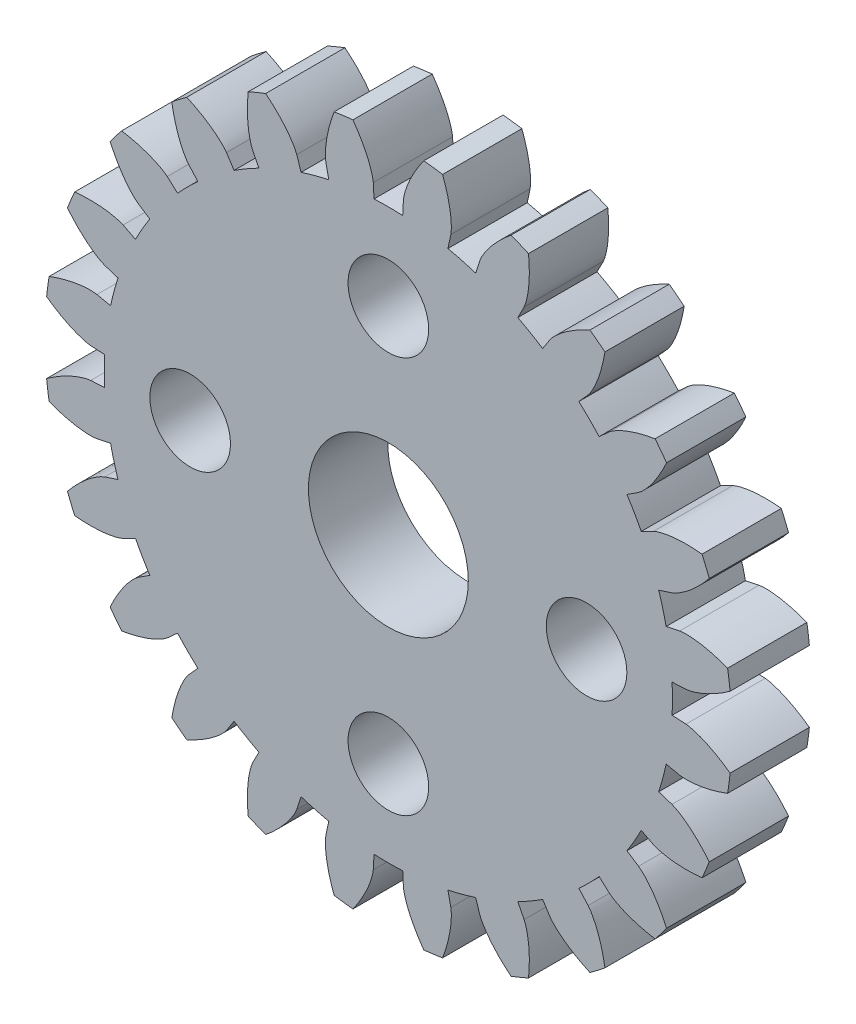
from build123d import *

# Parameters (mm, degrees)
EXTRUDE_1200_DEPTH          = 3
SKETCH_1285_R               = 37.176964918
SKETCH_1285_R_2             = 13
CUT_EXTRUDE_1626_DEPTH      = 39.958796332
CUT_EXTRUDE_2146_DEPTH      = 19.579565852
PATTERN_CIRCULAR_2249_COUNT = 24
SKETCH_2309_R               = 10.75
EXTRUDE_2632_DEPTH          = 3
SKETCH_3196_R               = 3.025
CUT_EXTRUDE_3847_DEPTH      = 19.53106928
SKETCH_1_R                  = 1.525
CUT_EXTRUDE_1_DEPTH         = 19.53106928


with BuildPart() as part:
    # Sketch 1018 → Extrude 1200 (new body)
    with BuildSketch(Plane.XY):
        with BuildLine():
            Line((-34.810597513, -13.051782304), (0.569734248, -11.261909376))
            Line((0.569734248, -11.261909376), (0, 0))
            Line((0, 0), (0, 10.73627013))
            Line((0, 10.73627013), (-0.543142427, 10.73627013))
            Line((-0.543142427, 10.73627013), (-0.569734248, 11.261909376))
            add(Edge.make_bspline(
                [(-0.569734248, 11.261909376), (-0.574039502, 11.304625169), (-0.58662303, 11.389421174), (-0.624880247, 11.548358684), (-0.699627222, 11.777149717), (-0.859532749, 12.161314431), (-1.181341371, 12.739542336), (-1.715210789, 13.454141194), (-2.596612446, 14.335278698), (-3.772336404, 15.202010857), (-5.187237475, 15.95872787), (-6.809569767, 16.555777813), (-8.492340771, 16.947544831), (-10.208004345, 17.146764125), (-12.020014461, 17.16644959), (-14.254309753, 16.95681711), (-16.868761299, 16.366827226), (-19.775097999, 15.244890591), (-22.771942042, 13.514750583), (-25.487635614, 11.372766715), (-27.888534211, 8.884747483), (-29.693862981, 6.45824407), (-31.021257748, 4.235120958), (-31.978360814, 2.303342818), (-32.653986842, 0.71630306), (-33.239321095, -0.905719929), (-33.734316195, -2.558294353), (-34.240622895, -4.652865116), (-34.597645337, -6.781899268), (-34.786628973, -8.711035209), (-34.848980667, -10.330102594), (-34.857641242, -11.185847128), (-34.853055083, -11.769522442), (-34.844894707, -12.225859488), (-34.828408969, -12.671101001), (-34.816961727, -12.925981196), (-34.810597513, -13.051782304)],
                knots=[0, 0, 0, 0, 0, 0.002802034, 0.005604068, 0.010661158, 0.015718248, 0.029959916, 0.048733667, 0.068727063, 0.096888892, 0.125050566, 0.153212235, 0.18137365, 0.209534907, 0.23769631, 0.271429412, 0.327752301, 0.384075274, 0.440398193, 0.496721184, 0.553044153, 0.609367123, 0.637528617, 0.665690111, 0.693851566, 0.72201302, 0.750174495, 0.77833597, 0.834658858, 0.862820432, 0.876901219, 0.883941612, 0.890982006, 0.90003647, 0.909090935, 0.909090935, 0.909090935, 0.909090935, 0.909090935], degree=4))
        make_face()
    extrude(amount=EXTRUDE_1200_DEPTH)

    # Mirror 1246: part across plane


with BuildPart() as part_1:
    add(part.part)
    add(part.part.mirror(Plane(origin=(0, 0, 3), x_dir=(0, 0, 1), z_dir=(1, 0, 0))))

    # Sketch 1285 → Cut-Extrude 1626 (cut, through all)
    with BuildSketch(Plane.XY.offset(3)):
        Circle(SKETCH_1285_R)
        Circle(SKETCH_1285_R_2, mode=Mode.SUBTRACT)
    extrude(amount=-CUT_EXTRUDE_1626_DEPTH, mode=Mode.SUBTRACT)

    # Sketch 1786 → Cut-Extrude 2146 (cut, through all)
    with BuildSketch(Plane.XY.offset(3)):
        with BuildLine():
            Line((-1.696840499, 12.888783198), (0, 0))
            Line((0, 0), (1.696840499, 12.888783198))
            ThreePointArc((1.696840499, 12.888783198), (0, -13), (-1.696840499, 12.888783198))
        make_face()
    extrude(amount=-CUT_EXTRUDE_2146_DEPTH, mode=Mode.SUBTRACT)


with BuildPart() as pattern_circular_2249_1:
    # Pattern Circular 2249: pattern copy
    add(part_1.part.rotate(Axis((0, 0, 0), (0, 0, 1)), 1 * 360 / PATTERN_CIRCULAR_2249_COUNT))


with BuildPart() as pattern_circular_2249_2:
    # Pattern Circular 2249: pattern copy
    add(part_1.part.rotate(Axis((0, 0, 0), (0, 0, 1)), 2 * 360 / PATTERN_CIRCULAR_2249_COUNT))


with BuildPart() as pattern_circular_2249_3:
    # Pattern Circular 2249: pattern copy
    add(part_1.part.rotate(Axis((0, 0, 0), (0, 0, 1)), 3 * 360 / PATTERN_CIRCULAR_2249_COUNT))


with BuildPart() as pattern_circular_2249_4:
    # Pattern Circular 2249: pattern copy
    add(part_1.part.rotate(Axis((0, 0, 0), (0, 0, 1)), 4 * 360 / PATTERN_CIRCULAR_2249_COUNT))


with BuildPart() as pattern_circular_2249_5:
    # Pattern Circular 2249: pattern copy
    add(part_1.part.rotate(Axis((0, 0, 0), (0, 0, 1)), 5 * 360 / PATTERN_CIRCULAR_2249_COUNT))


with BuildPart() as pattern_circular_2249_6:
    # Pattern Circular 2249: pattern copy
    add(part_1.part.rotate(Axis((0, 0, 0), (0, 0, 1)), 6 * 360 / PATTERN_CIRCULAR_2249_COUNT))


with BuildPart() as pattern_circular_2249_7:
    # Pattern Circular 2249: pattern copy
    add(part_1.part.rotate(Axis((0, 0, 0), (0, 0, 1)), 7 * 360 / PATTERN_CIRCULAR_2249_COUNT))


with BuildPart() as pattern_circular_2249_8:
    # Pattern Circular 2249: pattern copy
    add(part_1.part.rotate(Axis((0, 0, 0), (0, 0, 1)), 8 * 360 / PATTERN_CIRCULAR_2249_COUNT))


with BuildPart() as pattern_circular_2249_9:
    # Pattern Circular 2249: pattern copy
    add(part_1.part.rotate(Axis((0, 0, 0), (0, 0, 1)), 9 * 360 / PATTERN_CIRCULAR_2249_COUNT))


with BuildPart() as pattern_circular_2249_10:
    # Pattern Circular 2249: pattern copy
    add(part_1.part.rotate(Axis((0, 0, 0), (0, 0, 1)), 10 * 360 / PATTERN_CIRCULAR_2249_COUNT))


with BuildPart() as pattern_circular_2249_11:
    # Pattern Circular 2249: pattern copy
    add(part_1.part.rotate(Axis((0, 0, 0), (0, 0, 1)), 11 * 360 / PATTERN_CIRCULAR_2249_COUNT))


with BuildPart() as pattern_circular_2249_12:
    # Pattern Circular 2249: pattern copy
    add(part_1.part.rotate(Axis((0, 0, 0), (0, 0, 1)), 12 * 360 / PATTERN_CIRCULAR_2249_COUNT))


with BuildPart() as pattern_circular_2249_13:
    # Pattern Circular 2249: pattern copy
    add(part_1.part.rotate(Axis((0, 0, 0), (0, 0, 1)), 13 * 360 / PATTERN_CIRCULAR_2249_COUNT))


with BuildPart() as pattern_circular_2249_14:
    # Pattern Circular 2249: pattern copy
    add(part_1.part.rotate(Axis((0, 0, 0), (0, 0, 1)), 14 * 360 / PATTERN_CIRCULAR_2249_COUNT))


with BuildPart() as pattern_circular_2249_15:
    # Pattern Circular 2249: pattern copy
    add(part_1.part.rotate(Axis((0, 0, 0), (0, 0, 1)), 15 * 360 / PATTERN_CIRCULAR_2249_COUNT))


with BuildPart() as pattern_circular_2249_16:
    # Pattern Circular 2249: pattern copy
    add(part_1.part.rotate(Axis((0, 0, 0), (0, 0, 1)), 16 * 360 / PATTERN_CIRCULAR_2249_COUNT))


with BuildPart() as pattern_circular_2249_17:
    # Pattern Circular 2249: pattern copy
    add(part_1.part.rotate(Axis((0, 0, 0), (0, 0, 1)), 17 * 360 / PATTERN_CIRCULAR_2249_COUNT))


with BuildPart() as pattern_circular_2249_18:
    # Pattern Circular 2249: pattern copy
    add(part_1.part.rotate(Axis((0, 0, 0), (0, 0, 1)), 18 * 360 / PATTERN_CIRCULAR_2249_COUNT))


with BuildPart() as pattern_circular_2249_19:
    # Pattern Circular 2249: pattern copy
    add(part_1.part.rotate(Axis((0, 0, 0), (0, 0, 1)), 19 * 360 / PATTERN_CIRCULAR_2249_COUNT))


with BuildPart() as pattern_circular_2249_20:
    # Pattern Circular 2249: pattern copy
    add(part_1.part.rotate(Axis((0, 0, 0), (0, 0, 1)), 20 * 360 / PATTERN_CIRCULAR_2249_COUNT))


with BuildPart() as pattern_circular_2249_21:
    # Pattern Circular 2249: pattern copy
    add(part_1.part.rotate(Axis((0, 0, 0), (0, 0, 1)), 21 * 360 / PATTERN_CIRCULAR_2249_COUNT))


with BuildPart() as pattern_circular_2249_22:
    # Pattern Circular 2249: pattern copy
    add(part_1.part.rotate(Axis((0, 0, 0), (0, 0, 1)), 22 * 360 / PATTERN_CIRCULAR_2249_COUNT))


with BuildPart() as pattern_circular_2249_23:
    # Pattern Circular 2249: pattern copy
    add(part_1.part.rotate(Axis((0, 0, 0), (0, 0, 1)), 23 * 360 / PATTERN_CIRCULAR_2249_COUNT))


with BuildPart() as part_2:
    add(part_1.part)

    add(pattern_circular_2249_1.part)  # Extrude 2632 merges Pattern Circular 2249_1

    add(pattern_circular_2249_2.part)  # Extrude 2632 merges Pattern Circular 2249_2

    add(pattern_circular_2249_3.part)  # Extrude 2632 merges Pattern Circular 2249_3

    add(pattern_circular_2249_4.part)  # Extrude 2632 merges Pattern Circular 2249_4

    add(pattern_circular_2249_5.part)  # Extrude 2632 merges Pattern Circular 2249_5

    add(pattern_circular_2249_6.part)  # Extrude 2632 merges Pattern Circular 2249_6

    add(pattern_circular_2249_7.part)  # Extrude 2632 merges Pattern Circular 2249_7

    add(pattern_circular_2249_8.part)  # Extrude 2632 merges Pattern Circular 2249_8

    add(pattern_circular_2249_9.part)  # Extrude 2632 merges Pattern Circular 2249_9

    add(pattern_circular_2249_10.part)  # Extrude 2632 merges Pattern Circular 2249_10

    add(pattern_circular_2249_11.part)  # Extrude 2632 merges Pattern Circular 2249_11

    add(pattern_circular_2249_12.part)  # Extrude 2632 merges Pattern Circular 2249_12

    add(pattern_circular_2249_13.part)  # Extrude 2632 merges Pattern Circular 2249_13

    add(pattern_circular_2249_14.part)  # Extrude 2632 merges Pattern Circular 2249_14

    add(pattern_circular_2249_15.part)  # Extrude 2632 merges Pattern Circular 2249_15

    add(pattern_circular_2249_16.part)  # Extrude 2632 merges Pattern Circular 2249_16

    add(pattern_circular_2249_17.part)  # Extrude 2632 merges Pattern Circular 2249_17

    add(pattern_circular_2249_18.part)  # Extrude 2632 merges Pattern Circular 2249_18

    add(pattern_circular_2249_19.part)  # Extrude 2632 merges Pattern Circular 2249_19

    add(pattern_circular_2249_20.part)  # Extrude 2632 merges Pattern Circular 2249_20

    add(pattern_circular_2249_21.part)  # Extrude 2632 merges Pattern Circular 2249_21

    add(pattern_circular_2249_22.part)  # Extrude 2632 merges Pattern Circular 2249_22

    add(pattern_circular_2249_23.part)  # Extrude 2632 merges Pattern Circular 2249_23
    # Sketch 2309 → Extrude 2632 (add, through all)
    with BuildSketch(Plane.XY.offset(3)):
        Circle(SKETCH_2309_R)
    extrude(amount=-EXTRUDE_2632_DEPTH)

    # Sketch 3196 → Cut-Extrude 3847 (cut, through all)
    with BuildSketch(Plane.XY.offset(3)):
        Circle(SKETCH_3196_R)
    extrude(amount=-CUT_EXTRUDE_3847_DEPTH, mode=Mode.SUBTRACT)

    # Sketch 1 → Cut-Extrude 1 (cut, through all)
    with BuildSketch(Plane.XY.offset(3)):
        with Locations((7.5, 0)):
            Circle(SKETCH_1_R)
        with Locations((0, -7.5)):
            Circle(SKETCH_1_R)
        with Locations((-7.5, 0)):
            Circle(SKETCH_1_R)
        with Locations((0, 7.5)):
            Circle(SKETCH_1_R)
    extrude(amount=-CUT_EXTRUDE_1_DEPTH, mode=Mode.SUBTRACT)


solid = part_2.part
